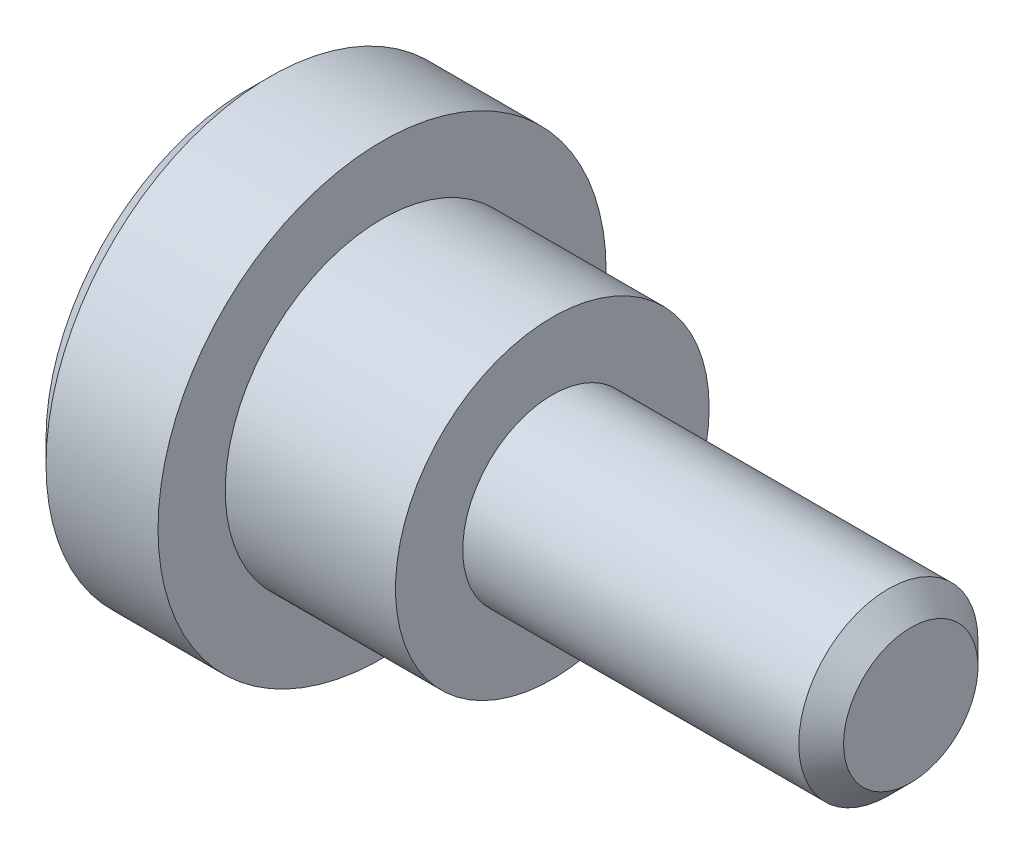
ISO-10303-21;
HEADER;
FILE_DESCRIPTION(('STEP AP214'),'2;1');
FILE_NAME('part.step','',(''),(''),'','','');
FILE_SCHEMA(('AUTOMOTIVE_DESIGN { 1 0 10303 214 1 1 1 1 }'));
ENDSEC;
DATA;
#1=APPLICATION_CONTEXT('core data for automotive mechanical design processes');
#2=APPLICATION_PROTOCOL_DEFINITION('international standard','automotive_design',2000,#1);
#3=PRODUCT_CONTEXT('',#1,'mechanical');
#4=PRODUCT('Part','Part','',(#3));
#5=PRODUCT_RELATED_PRODUCT_CATEGORY('part','',(#4));
#6=PRODUCT_DEFINITION_FORMATION('','',#4);
#7=PRODUCT_DEFINITION_CONTEXT('part definition',#1,'design');
#8=PRODUCT_DEFINITION('design','',#6,#7);
#9=PRODUCT_DEFINITION_SHAPE('','',#8);
#10=(LENGTH_UNIT() NAMED_UNIT(*) SI_UNIT(.MILLI.,.METRE.));
#11=(NAMED_UNIT(*) PLANE_ANGLE_UNIT() SI_UNIT($,.RADIAN.));
#12=(NAMED_UNIT(*) SI_UNIT($,.STERADIAN.) SOLID_ANGLE_UNIT());
#13=UNCERTAINTY_MEASURE_WITH_UNIT(LENGTH_MEASURE(1.E-05),#10,'distance_accuracy_value','');
#14=(GEOMETRIC_REPRESENTATION_CONTEXT(3) GLOBAL_UNCERTAINTY_ASSIGNED_CONTEXT((#13)) GLOBAL_UNIT_ASSIGNED_CONTEXT((#10,
#11,#12)) REPRESENTATION_CONTEXT('',''));
#15=CARTESIAN_POINT('',(0.,0.,0.));
#16=DIRECTION('',(0.,0.,1.));
#17=DIRECTION('',(1.,0.,0.));
#18=AXIS2_PLACEMENT_3D('',#15,#16,#17);
#19=CARTESIAN_POINT('',(0.,2.25,0.));
#20=DIRECTION('',(-1.,0.,0.));
#21=DIRECTION('',(0.,0.,1.));
#22=AXIS2_PLACEMENT_3D('',#19,#20,#21);
#23=PLANE('',#22);
#24=CARTESIAN_POINT('',(-2.27373675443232E-10,0.,0.));
#25=DIRECTION('',(1.,0.,0.));
#26=DIRECTION('',(0.,0.,-1.));
#27=AXIS2_PLACEMENT_3D('',#24,#25,#26);
#28=CIRCLE('',#27,4.50000000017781);
#29=CARTESIAN_POINT('',(-2.27373675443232E-10,0.,-4.50000000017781));
#30=VERTEX_POINT('',#29);
#31=EDGE_CURVE('E18',#30,#30,#28,.T.);
#32=ORIENTED_EDGE('',*,*,#31,.F.);
#33=EDGE_LOOP('',(#32));
#34=FACE_BOUND('',#33,.T.);
#35=ADVANCED_FACE('F15',(#34),#23,.T.);
#36=CARTESIAN_POINT('',(0.50000000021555,0.,0.));
#37=DIRECTION('',(1.,0.,0.));
#38=DIRECTION('',(0.,0.,-1.));
#39=AXIS2_PLACEMENT_3D('',#36,#37,#38);
#40=CONICAL_SURFACE('',#39,4.99999999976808,0.785398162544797);
#41=ORIENTED_EDGE('',*,*,#31,.T.);
#42=EDGE_LOOP('',(#41));
#43=FACE_BOUND('',#42,.T.);
#44=CARTESIAN_POINT('',(0.5,0.,0.));
#45=DIRECTION('',(1.,0.,0.));
#46=DIRECTION('',(0.,0.,-1.));
#47=AXIS2_PLACEMENT_3D('',#44,#45,#46);
#48=CIRCLE('',#47,5.);
#49=CARTESIAN_POINT('',(0.5,0.,-5.));
#50=VERTEX_POINT('',#49);
#51=EDGE_CURVE('E42',#50,#50,#48,.T.);
#52=ORIENTED_EDGE('',*,*,#51,.F.);
#53=EDGE_LOOP('',(#52));
#54=FACE_BOUND('',#53,.T.);
#55=ADVANCED_FACE('F53',(#43,#54),#40,.T.);
#56=CARTESIAN_POINT('',(1.75,0.,0.));
#57=DIRECTION('',(1.,0.,0.));
#58=DIRECTION('',(0.,0.,-1.));
#59=AXIS2_PLACEMENT_3D('',#56,#57,#58);
#60=CYLINDRICAL_SURFACE('',#59,5.);
#61=ORIENTED_EDGE('',*,*,#51,.T.);
#62=EDGE_LOOP('',(#61));
#63=FACE_BOUND('',#62,.T.);
#64=CARTESIAN_POINT('',(3.,0.,0.));
#65=DIRECTION('',(1.,0.,0.));
#66=DIRECTION('',(0.,0.,-1.));
#67=AXIS2_PLACEMENT_3D('',#64,#65,#66);
#68=CIRCLE('',#67,5.);
#69=CARTESIAN_POINT('',(3.,0.,-5.));
#70=VERTEX_POINT('',#69);
#71=EDGE_CURVE('E40',#70,#70,#68,.T.);
#72=ORIENTED_EDGE('',*,*,#71,.F.);
#73=EDGE_LOOP('',(#72));
#74=FACE_BOUND('',#73,.T.);
#75=ADVANCED_FACE('F61',(#63,#74),#60,.T.);
#76=CARTESIAN_POINT('',(3.,4.25,0.));
#77=DIRECTION('',(1.,0.,0.));
#78=DIRECTION('',(0.,0.,-1.));
#79=AXIS2_PLACEMENT_3D('',#76,#77,#78);
#80=PLANE('',#79);
#81=CARTESIAN_POINT('',(3.,0.,0.));
#82=DIRECTION('',(1.,0.,0.));
#83=DIRECTION('',(0.,0.,-1.));
#84=AXIS2_PLACEMENT_3D('',#81,#82,#83);
#85=CIRCLE('',#84,3.5);
#86=CARTESIAN_POINT('',(3.,0.,-3.5));
#87=VERTEX_POINT('',#86);
#88=EDGE_CURVE('E38',#87,#87,#85,.T.);
#89=ORIENTED_EDGE('',*,*,#88,.F.);
#90=EDGE_LOOP('',(#89));
#91=FACE_BOUND('',#90,.T.);
#92=ORIENTED_EDGE('',*,*,#71,.T.);
#93=EDGE_LOOP('',(#92));
#94=FACE_BOUND('',#93,.T.);
#95=ADVANCED_FACE('F84',(#91,#94),#80,.T.);
#96=CARTESIAN_POINT('',(14.8,0.75,0.));
#97=DIRECTION('',(1.,0.,0.));
#98=DIRECTION('',(0.,0.,-1.));
#99=AXIS2_PLACEMENT_3D('',#96,#97,#98);
#100=PLANE('',#99);
#101=CARTESIAN_POINT('',(14.8000000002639,0.,0.));
#102=DIRECTION('',(-1.,0.,0.));
#103=DIRECTION('',(0.,0.,1.));
#104=AXIS2_PLACEMENT_3D('',#101,#102,#103);
#105=CIRCLE('',#104,1.50000000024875);
#106=CARTESIAN_POINT('',(14.8000000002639,0.,1.50000000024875));
#107=VERTEX_POINT('',#106);
#108=EDGE_CURVE('E35',#107,#107,#105,.T.);
#109=ORIENTED_EDGE('',*,*,#108,.F.);
#110=EDGE_LOOP('',(#109));
#111=FACE_BOUND('',#110,.T.);
#112=ADVANCED_FACE('F80',(#111),#100,.T.);
#113=CARTESIAN_POINT('',(4.9,0.,0.));
#114=DIRECTION('',(1.,0.,0.));
#115=DIRECTION('',(0.,0.,-1.));
#116=AXIS2_PLACEMENT_3D('',#113,#114,#115);
#117=CYLINDRICAL_SURFACE('',#116,3.5);
#118=ORIENTED_EDGE('',*,*,#88,.T.);
#119=EDGE_LOOP('',(#118));
#120=FACE_BOUND('',#119,.T.);
#121=CARTESIAN_POINT('',(6.8,0.,0.));
#122=DIRECTION('',(1.,0.,0.));
#123=DIRECTION('',(0.,0.,-1.));
#124=AXIS2_PLACEMENT_3D('',#121,#122,#123);
#125=CIRCLE('',#124,3.5);
#126=CARTESIAN_POINT('',(6.8,0.,-3.5));
#127=VERTEX_POINT('',#126);
#128=EDGE_CURVE('E27',#127,#127,#125,.T.);
#129=ORIENTED_EDGE('',*,*,#128,.F.);
#130=EDGE_LOOP('',(#129));
#131=FACE_BOUND('',#130,.T.);
#132=ADVANCED_FACE('F76',(#120,#131),#117,.T.);
#133=CARTESIAN_POINT('',(14.2999999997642,0.,0.));
#134=DIRECTION('',(-1.,0.,0.));
#135=DIRECTION('',(0.,0.,1.));
#136=AXIS2_PLACEMENT_3D('',#133,#134,#135);
#137=CONICAL_SURFACE('',#136,1.99999999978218,0.78539816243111);
#138=CARTESIAN_POINT('',(14.3,0.,0.));
#139=DIRECTION('',(1.,0.,0.));
#140=DIRECTION('',(0.,0.,-1.));
#141=AXIS2_PLACEMENT_3D('',#138,#139,#140);
#142=CIRCLE('',#141,2.);
#143=CARTESIAN_POINT('',(14.3,0.,-2.));
#144=VERTEX_POINT('',#143);
#145=EDGE_CURVE('E22',#144,#144,#142,.F.);
#146=ORIENTED_EDGE('',*,*,#145,.F.);
#147=EDGE_LOOP('',(#146));
#148=FACE_BOUND('',#147,.T.);
#149=ORIENTED_EDGE('',*,*,#108,.T.);
#150=EDGE_LOOP('',(#149));
#151=FACE_BOUND('',#150,.T.);
#152=ADVANCED_FACE('F69',(#148,#151),#137,.T.);
#153=CARTESIAN_POINT('',(6.8,2.75,0.));
#154=DIRECTION('',(1.,0.,0.));
#155=DIRECTION('',(0.,0.,-1.));
#156=AXIS2_PLACEMENT_3D('',#153,#154,#155);
#157=PLANE('',#156);
#158=CARTESIAN_POINT('',(6.8,0.,0.));
#159=DIRECTION('',(1.,0.,0.));
#160=DIRECTION('',(0.,0.,-1.));
#161=AXIS2_PLACEMENT_3D('',#158,#159,#160);
#162=CIRCLE('',#161,2.);
#163=CARTESIAN_POINT('',(6.8,0.,-2.));
#164=VERTEX_POINT('',#163);
#165=EDGE_CURVE('E10',#164,#164,#162,.T.);
#166=ORIENTED_EDGE('',*,*,#165,.F.);
#167=EDGE_LOOP('',(#166));
#168=FACE_BOUND('',#167,.T.);
#169=ORIENTED_EDGE('',*,*,#128,.T.);
#170=EDGE_LOOP('',(#169));
#171=FACE_BOUND('',#170,.T.);
#172=ADVANCED_FACE('F64',(#168,#171),#157,.T.);
#173=CARTESIAN_POINT('',(10.55,0.,0.));
#174=DIRECTION('',(1.,0.,0.));
#175=DIRECTION('',(0.,0.,-1.));
#176=AXIS2_PLACEMENT_3D('',#173,#174,#175);
#177=CYLINDRICAL_SURFACE('',#176,2.);
#178=ORIENTED_EDGE('',*,*,#165,.T.);
#179=EDGE_LOOP('',(#178));
#180=FACE_BOUND('',#179,.T.);
#181=ORIENTED_EDGE('',*,*,#145,.T.);
#182=EDGE_LOOP('',(#181));
#183=FACE_BOUND('',#182,.T.);
#184=ADVANCED_FACE('F62',(#180,#183),#177,.T.);
#185=CLOSED_SHELL('',(#35,#55,#75,#95,#112,#132,#152,#172,#184));
#186=MANIFOLD_SOLID_BREP('B1',#185);
#187=ADVANCED_BREP_SHAPE_REPRESENTATION('',(#18,#186),#14);
#188=SHAPE_DEFINITION_REPRESENTATION(#9,#187);
ENDSEC;
END-ISO-10303-21;
